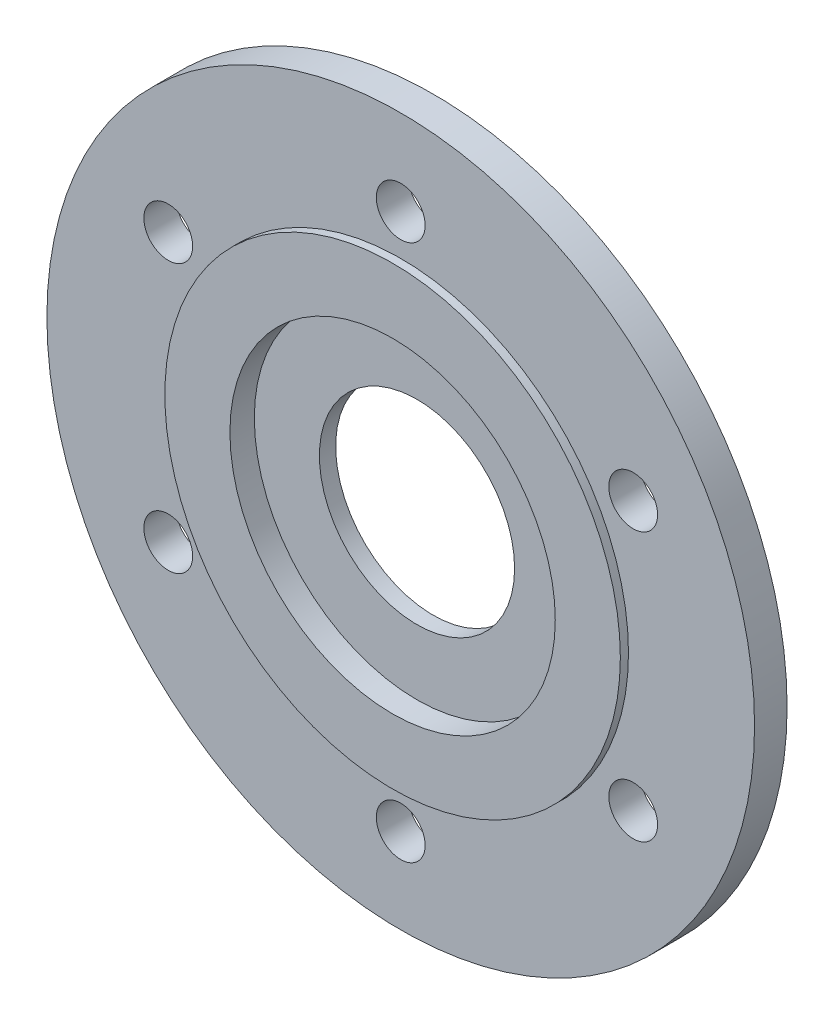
ISO-10303-21;
HEADER;
FILE_DESCRIPTION(('STEP AP214'),'2;1');
FILE_NAME('part.step','',(''),(''),'','','');
FILE_SCHEMA(('AUTOMOTIVE_DESIGN { 1 0 10303 214 1 1 1 1 }'));
ENDSEC;
DATA;
#1=APPLICATION_CONTEXT('core data for automotive mechanical design processes');
#2=APPLICATION_PROTOCOL_DEFINITION('international standard','automotive_design',2000,#1);
#3=PRODUCT_CONTEXT('',#1,'mechanical');
#4=PRODUCT('Part','Part','',(#3));
#5=PRODUCT_RELATED_PRODUCT_CATEGORY('part','',(#4));
#6=PRODUCT_DEFINITION_FORMATION('','',#4);
#7=PRODUCT_DEFINITION_CONTEXT('part definition',#1,'design');
#8=PRODUCT_DEFINITION('design','',#6,#7);
#9=PRODUCT_DEFINITION_SHAPE('','',#8);
#10=(LENGTH_UNIT() NAMED_UNIT(*) SI_UNIT(.MILLI.,.METRE.));
#11=(NAMED_UNIT(*) PLANE_ANGLE_UNIT() SI_UNIT($,.RADIAN.));
#12=(NAMED_UNIT(*) SI_UNIT($,.STERADIAN.) SOLID_ANGLE_UNIT());
#13=UNCERTAINTY_MEASURE_WITH_UNIT(LENGTH_MEASURE(1.E-05),#10,'distance_accuracy_value','');
#14=(GEOMETRIC_REPRESENTATION_CONTEXT(3) GLOBAL_UNCERTAINTY_ASSIGNED_CONTEXT((#13)) GLOBAL_UNIT_ASSIGNED_CONTEXT((#10,
#11,#12)) REPRESENTATION_CONTEXT('',''));
#15=CARTESIAN_POINT('',(0.,0.,0.));
#16=DIRECTION('',(0.,0.,1.));
#17=DIRECTION('',(1.,0.,0.));
#18=AXIS2_PLACEMENT_3D('',#15,#16,#17);
#19=CARTESIAN_POINT('',(0.,0.,4.));
#20=DIRECTION('',(0.,0.,1.));
#21=DIRECTION('',(1.,0.,0.));
#22=AXIS2_PLACEMENT_3D('',#19,#20,#21);
#23=PLANE('',#22);
#24=CARTESIAN_POINT('',(-28.5788383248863,16.5000000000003,4.));
#25=DIRECTION('',(0.,0.,1.));
#26=DIRECTION('',(0.50000000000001,0.866025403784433,0.));
#27=AXIS2_PLACEMENT_3D('',#24,#25,#26);
#28=CIRCLE('',#27,3.);
#29=CARTESIAN_POINT('',(-27.0788383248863,19.0980762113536,4.));
#30=VERTEX_POINT('',#29);
#31=EDGE_CURVE('E94',#30,#30,#28,.T.);
#32=ORIENTED_EDGE('',*,*,#31,.F.);
#33=EDGE_LOOP('',(#32));
#34=FACE_BOUND('',#33,.T.);
#35=CARTESIAN_POINT('',(-28.5788383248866,-16.4999999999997,4.));
#36=DIRECTION('',(0.,0.,1.));
#37=DIRECTION('',(-0.499999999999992,0.866025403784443,0.));
#38=AXIS2_PLACEMENT_3D('',#35,#36,#37);
#39=CIRCLE('',#38,3.);
#40=CARTESIAN_POINT('',(-30.0788383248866,-13.9019237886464,4.));
#41=VERTEX_POINT('',#40);
#42=EDGE_CURVE('E88',#41,#41,#39,.T.);
#43=ORIENTED_EDGE('',*,*,#42,.F.);
#44=EDGE_LOOP('',(#43));
#45=FACE_BOUND('',#44,.T.);
#46=CARTESIAN_POINT('',(-2.32187805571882E-13,-33.,4.));
#47=DIRECTION('',(0.,0.,1.));
#48=DIRECTION('',(-1.,0.,0.));
#49=AXIS2_PLACEMENT_3D('',#46,#47,#48);
#50=CIRCLE('',#49,3.);
#51=CARTESIAN_POINT('',(-3.00000000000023,-33.,4.));
#52=VERTEX_POINT('',#51);
#53=EDGE_CURVE('E82',#52,#52,#50,.T.);
#54=ORIENTED_EDGE('',*,*,#53,.F.);
#55=EDGE_LOOP('',(#54));
#56=FACE_BOUND('',#55,.T.);
#57=CARTESIAN_POINT('',(28.5788383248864,-16.5000000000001,4.));
#58=DIRECTION('',(0.,0.,1.));
#59=DIRECTION('',(-0.500000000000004,-0.866025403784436,0.));
#60=AXIS2_PLACEMENT_3D('',#57,#58,#59);
#61=CIRCLE('',#60,3.);
#62=CARTESIAN_POINT('',(27.0788383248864,-19.0980762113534,4.));
#63=VERTEX_POINT('',#62);
#64=EDGE_CURVE('E76',#63,#63,#61,.T.);
#65=ORIENTED_EDGE('',*,*,#64,.F.);
#66=EDGE_LOOP('',(#65));
#67=FACE_BOUND('',#66,.T.);
#68=CARTESIAN_POINT('',(28.5788383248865,16.4999999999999,4.));
#69=DIRECTION('',(0.,0.,1.));
#70=DIRECTION('',(0.499999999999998,-0.86602540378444,0.));
#71=AXIS2_PLACEMENT_3D('',#68,#69,#70);
#72=CIRCLE('',#71,3.);
#73=CARTESIAN_POINT('',(30.0788383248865,13.9019237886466,4.));
#74=VERTEX_POINT('',#73);
#75=EDGE_CURVE('E70',#74,#74,#72,.T.);
#76=ORIENTED_EDGE('',*,*,#75,.F.);
#77=EDGE_LOOP('',(#76));
#78=FACE_BOUND('',#77,.T.);
#79=CARTESIAN_POINT('',(0.,33.,4.));
#80=DIRECTION('',(0.,0.,1.));
#81=DIRECTION('',(1.,0.,0.));
#82=AXIS2_PLACEMENT_3D('',#79,#80,#81);
#83=CIRCLE('',#82,3.);
#84=CARTESIAN_POINT('',(3.,33.,4.));
#85=VERTEX_POINT('',#84);
#86=EDGE_CURVE('E64',#85,#85,#83,.T.);
#87=ORIENTED_EDGE('',*,*,#86,.F.);
#88=EDGE_LOOP('',(#87));
#89=FACE_BOUND('',#88,.T.);
#90=CARTESIAN_POINT('',(0.,0.,4.));
#91=DIRECTION('',(0.,0.,1.));
#92=DIRECTION('',(1.,0.,0.));
#93=AXIS2_PLACEMENT_3D('',#90,#91,#92);
#94=CIRCLE('',#93,43.5);
#95=CARTESIAN_POINT('',(43.5,0.,4.));
#96=VERTEX_POINT('',#95);
#97=EDGE_CURVE('E10',#96,#96,#94,.T.);
#98=ORIENTED_EDGE('',*,*,#97,.T.);
#99=EDGE_LOOP('',(#98));
#100=FACE_BOUND('',#99,.T.);
#101=CARTESIAN_POINT('',(0.,0.,4.));
#102=DIRECTION('',(0.,0.,1.));
#103=DIRECTION('',(1.,0.,0.));
#104=AXIS2_PLACEMENT_3D('',#101,#102,#103);
#105=CIRCLE('',#104,28.);
#106=CARTESIAN_POINT('',(28.,0.,4.));
#107=VERTEX_POINT('',#106);
#108=EDGE_CURVE('E44',#107,#107,#105,.T.);
#109=ORIENTED_EDGE('',*,*,#108,.F.);
#110=EDGE_LOOP('',(#109));
#111=FACE_BOUND('',#110,.T.);
#112=ADVANCED_FACE('F29',(#34,#45,#56,#67,#78,#89,#100,#111),#23,.T.);
#113=CARTESIAN_POINT('',(0.,0.,4.));
#114=DIRECTION('',(0.,0.,-1.));
#115=DIRECTION('',(-1.,0.,0.));
#116=AXIS2_PLACEMENT_3D('',#113,#114,#115);
#117=CYLINDRICAL_SURFACE('',#116,43.5);
#118=ORIENTED_EDGE('',*,*,#97,.F.);
#119=EDGE_LOOP('',(#118));
#120=FACE_BOUND('',#119,.T.);
#121=CARTESIAN_POINT('',(0.,0.,0.));
#122=DIRECTION('',(0.,0.,1.));
#123=DIRECTION('',(1.,0.,0.));
#124=AXIS2_PLACEMENT_3D('',#121,#122,#123);
#125=CIRCLE('',#124,43.5);
#126=CARTESIAN_POINT('',(43.5,0.,0.));
#127=VERTEX_POINT('',#126);
#128=EDGE_CURVE('E36',#127,#127,#125,.T.);
#129=ORIENTED_EDGE('',*,*,#128,.T.);
#130=EDGE_LOOP('',(#129));
#131=FACE_BOUND('',#130,.T.);
#132=ADVANCED_FACE('F31',(#120,#131),#117,.T.);
#133=CARTESIAN_POINT('',(0.,0.,0.));
#134=DIRECTION('',(0.,0.,1.));
#135=DIRECTION('',(1.,0.,0.));
#136=AXIS2_PLACEMENT_3D('',#133,#134,#135);
#137=PLANE('',#136);
#138=CARTESIAN_POINT('',(-28.5788383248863,16.5000000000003,0.));
#139=DIRECTION('',(0.,0.,1.));
#140=DIRECTION('',(0.50000000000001,0.866025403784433,0.));
#141=AXIS2_PLACEMENT_3D('',#138,#139,#140);
#142=CIRCLE('',#141,3.);
#143=CARTESIAN_POINT('',(-27.0788383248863,19.0980762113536,0.));
#144=VERTEX_POINT('',#143);
#145=EDGE_CURVE('E91',#144,#144,#142,.T.);
#146=ORIENTED_EDGE('',*,*,#145,.T.);
#147=EDGE_LOOP('',(#146));
#148=FACE_BOUND('',#147,.T.);
#149=CARTESIAN_POINT('',(-28.5788383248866,-16.4999999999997,0.));
#150=DIRECTION('',(0.,0.,1.));
#151=DIRECTION('',(-0.499999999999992,0.866025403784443,0.));
#152=AXIS2_PLACEMENT_3D('',#149,#150,#151);
#153=CIRCLE('',#152,3.);
#154=CARTESIAN_POINT('',(-30.0788383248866,-13.9019237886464,0.));
#155=VERTEX_POINT('',#154);
#156=EDGE_CURVE('E85',#155,#155,#153,.T.);
#157=ORIENTED_EDGE('',*,*,#156,.T.);
#158=EDGE_LOOP('',(#157));
#159=FACE_BOUND('',#158,.T.);
#160=CARTESIAN_POINT('',(-2.32187805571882E-13,-33.,0.));
#161=DIRECTION('',(0.,0.,1.));
#162=DIRECTION('',(-1.,0.,0.));
#163=AXIS2_PLACEMENT_3D('',#160,#161,#162);
#164=CIRCLE('',#163,3.);
#165=CARTESIAN_POINT('',(-3.00000000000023,-33.,0.));
#166=VERTEX_POINT('',#165);
#167=EDGE_CURVE('E79',#166,#166,#164,.T.);
#168=ORIENTED_EDGE('',*,*,#167,.T.);
#169=EDGE_LOOP('',(#168));
#170=FACE_BOUND('',#169,.T.);
#171=CARTESIAN_POINT('',(28.5788383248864,-16.5000000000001,0.));
#172=DIRECTION('',(0.,0.,1.));
#173=DIRECTION('',(-0.500000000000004,-0.866025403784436,0.));
#174=AXIS2_PLACEMENT_3D('',#171,#172,#173);
#175=CIRCLE('',#174,3.);
#176=CARTESIAN_POINT('',(27.0788383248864,-19.0980762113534,0.));
#177=VERTEX_POINT('',#176);
#178=EDGE_CURVE('E73',#177,#177,#175,.T.);
#179=ORIENTED_EDGE('',*,*,#178,.T.);
#180=EDGE_LOOP('',(#179));
#181=FACE_BOUND('',#180,.T.);
#182=CARTESIAN_POINT('',(28.5788383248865,16.4999999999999,0.));
#183=DIRECTION('',(0.,0.,1.));
#184=DIRECTION('',(0.499999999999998,-0.86602540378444,0.));
#185=AXIS2_PLACEMENT_3D('',#182,#183,#184);
#186=CIRCLE('',#185,3.);
#187=CARTESIAN_POINT('',(30.0788383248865,13.9019237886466,0.));
#188=VERTEX_POINT('',#187);
#189=EDGE_CURVE('E67',#188,#188,#186,.T.);
#190=ORIENTED_EDGE('',*,*,#189,.T.);
#191=EDGE_LOOP('',(#190));
#192=FACE_BOUND('',#191,.T.);
#193=CARTESIAN_POINT('',(0.,33.,0.));
#194=DIRECTION('',(0.,0.,1.));
#195=DIRECTION('',(1.,0.,0.));
#196=AXIS2_PLACEMENT_3D('',#193,#194,#195);
#197=CIRCLE('',#196,3.);
#198=CARTESIAN_POINT('',(3.,33.,0.));
#199=VERTEX_POINT('',#198);
#200=EDGE_CURVE('E61',#199,#199,#197,.T.);
#201=ORIENTED_EDGE('',*,*,#200,.T.);
#202=EDGE_LOOP('',(#201));
#203=FACE_BOUND('',#202,.T.);
#204=CARTESIAN_POINT('',(0.,0.,0.));
#205=DIRECTION('',(0.,0.,1.));
#206=DIRECTION('',(1.,0.,0.));
#207=AXIS2_PLACEMENT_3D('',#204,#205,#206);
#208=CIRCLE('',#207,12.);
#209=CARTESIAN_POINT('',(12.,0.,0.));
#210=VERTEX_POINT('',#209);
#211=EDGE_CURVE('E55',#210,#210,#208,.T.);
#212=ORIENTED_EDGE('',*,*,#211,.T.);
#213=EDGE_LOOP('',(#212));
#214=FACE_BOUND('',#213,.T.);
#215=ORIENTED_EDGE('',*,*,#128,.F.);
#216=EDGE_LOOP('',(#215));
#217=FACE_BOUND('',#216,.T.);
#218=ADVANCED_FACE('F117',(#148,#159,#170,#181,#192,#203,#214,#217),#137,.F.);
#219=CARTESIAN_POINT('',(0.,0.,5.));
#220=DIRECTION('',(0.,0.,-1.));
#221=DIRECTION('',(-1.,0.,0.));
#222=AXIS2_PLACEMENT_3D('',#219,#220,#221);
#223=CYLINDRICAL_SURFACE('',#222,28.);
#224=CARTESIAN_POINT('',(0.,0.,5.));
#225=DIRECTION('',(0.,0.,1.));
#226=DIRECTION('',(1.,0.,0.));
#227=AXIS2_PLACEMENT_3D('',#224,#225,#226);
#228=CIRCLE('',#227,28.);
#229=CARTESIAN_POINT('',(28.,0.,5.));
#230=VERTEX_POINT('',#229);
#231=EDGE_CURVE('E40',#230,#230,#228,.T.);
#232=ORIENTED_EDGE('',*,*,#231,.F.);
#233=EDGE_LOOP('',(#232));
#234=FACE_BOUND('',#233,.T.);
#235=ORIENTED_EDGE('',*,*,#108,.T.);
#236=EDGE_LOOP('',(#235));
#237=FACE_BOUND('',#236,.T.);
#238=ADVANCED_FACE('F114',(#234,#237),#223,.T.);
#239=CARTESIAN_POINT('',(0.,0.,5.));
#240=DIRECTION('',(0.,0.,1.));
#241=DIRECTION('',(1.,0.,0.));
#242=AXIS2_PLACEMENT_3D('',#239,#240,#241);
#243=PLANE('',#242);
#244=CARTESIAN_POINT('',(0.,0.,5.));
#245=DIRECTION('',(0.,0.,1.));
#246=DIRECTION('',(1.,0.,0.));
#247=AXIS2_PLACEMENT_3D('',#244,#245,#246);
#248=CIRCLE('',#247,20.);
#249=CARTESIAN_POINT('',(20.,0.,5.));
#250=VERTEX_POINT('',#249);
#251=EDGE_CURVE('E52',#250,#250,#248,.T.);
#252=ORIENTED_EDGE('',*,*,#251,.F.);
#253=EDGE_LOOP('',(#252));
#254=FACE_BOUND('',#253,.T.);
#255=ORIENTED_EDGE('',*,*,#231,.T.);
#256=EDGE_LOOP('',(#255));
#257=FACE_BOUND('',#256,.T.);
#258=ADVANCED_FACE('F116',(#254,#257),#243,.T.);
#259=CARTESIAN_POINT('',(0.,0.,2.));
#260=DIRECTION('',(0.,0.,1.));
#261=DIRECTION('',(1.,0.,0.));
#262=AXIS2_PLACEMENT_3D('',#259,#260,#261);
#263=CYLINDRICAL_SURFACE('',#262,20.);
#264=CARTESIAN_POINT('',(0.,0.,2.));
#265=DIRECTION('',(0.,0.,1.));
#266=DIRECTION('',(1.,0.,0.));
#267=AXIS2_PLACEMENT_3D('',#264,#265,#266);
#268=CIRCLE('',#267,20.);
#269=CARTESIAN_POINT('',(20.,0.,2.));
#270=VERTEX_POINT('',#269);
#271=EDGE_CURVE('E49',#270,#270,#268,.T.);
#272=ORIENTED_EDGE('',*,*,#271,.F.);
#273=EDGE_LOOP('',(#272));
#274=FACE_BOUND('',#273,.T.);
#275=ORIENTED_EDGE('',*,*,#251,.T.);
#276=EDGE_LOOP('',(#275));
#277=FACE_BOUND('',#276,.T.);
#278=ADVANCED_FACE('F124',(#274,#277),#263,.F.);
#279=CARTESIAN_POINT('',(0.,0.,2.));
#280=DIRECTION('',(0.,0.,1.));
#281=DIRECTION('',(1.,0.,0.));
#282=AXIS2_PLACEMENT_3D('',#279,#280,#281);
#283=PLANE('',#282);
#284=CARTESIAN_POINT('',(0.,0.,2.));
#285=DIRECTION('',(0.,0.,1.));
#286=DIRECTION('',(1.,0.,0.));
#287=AXIS2_PLACEMENT_3D('',#284,#285,#286);
#288=CIRCLE('',#287,12.);
#289=CARTESIAN_POINT('',(12.,0.,2.));
#290=VERTEX_POINT('',#289);
#291=EDGE_CURVE('E58',#290,#290,#288,.T.);
#292=ORIENTED_EDGE('',*,*,#291,.F.);
#293=EDGE_LOOP('',(#292));
#294=FACE_BOUND('',#293,.T.);
#295=ORIENTED_EDGE('',*,*,#271,.T.);
#296=EDGE_LOOP('',(#295));
#297=FACE_BOUND('',#296,.T.);
#298=ADVANCED_FACE('F134',(#294,#297),#283,.T.);
#299=CARTESIAN_POINT('',(0.,0.,0.));
#300=DIRECTION('',(0.,0.,1.));
#301=DIRECTION('',(1.,0.,0.));
#302=AXIS2_PLACEMENT_3D('',#299,#300,#301);
#303=CYLINDRICAL_SURFACE('',#302,12.);
#304=ORIENTED_EDGE('',*,*,#211,.F.);
#305=EDGE_LOOP('',(#304));
#306=FACE_BOUND('',#305,.T.);
#307=ORIENTED_EDGE('',*,*,#291,.T.);
#308=EDGE_LOOP('',(#307));
#309=FACE_BOUND('',#308,.T.);
#310=ADVANCED_FACE('F138',(#306,#309),#303,.F.);
#311=CARTESIAN_POINT('',(0.,33.,0.));
#312=DIRECTION('',(0.,0.,1.));
#313=DIRECTION('',(1.,0.,0.));
#314=AXIS2_PLACEMENT_3D('',#311,#312,#313);
#315=CYLINDRICAL_SURFACE('',#314,3.);
#316=ORIENTED_EDGE('',*,*,#200,.F.);
#317=EDGE_LOOP('',(#316));
#318=FACE_BOUND('',#317,.T.);
#319=ORIENTED_EDGE('',*,*,#86,.T.);
#320=EDGE_LOOP('',(#319));
#321=FACE_BOUND('',#320,.T.);
#322=ADVANCED_FACE('F142',(#318,#321),#315,.F.);
#323=CARTESIAN_POINT('',(28.5788383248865,16.4999999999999,0.));
#324=DIRECTION('',(0.,0.,1.));
#325=DIRECTION('',(1.,0.,0.));
#326=AXIS2_PLACEMENT_3D('',#323,#324,#325);
#327=CYLINDRICAL_SURFACE('',#326,3.);
#328=ORIENTED_EDGE('',*,*,#189,.F.);
#329=EDGE_LOOP('',(#328));
#330=FACE_BOUND('',#329,.T.);
#331=ORIENTED_EDGE('',*,*,#75,.T.);
#332=EDGE_LOOP('',(#331));
#333=FACE_BOUND('',#332,.T.);
#334=ADVANCED_FACE('F146',(#330,#333),#327,.F.);
#335=CARTESIAN_POINT('',(28.5788383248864,-16.5000000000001,0.));
#336=DIRECTION('',(0.,0.,1.));
#337=DIRECTION('',(1.,0.,0.));
#338=AXIS2_PLACEMENT_3D('',#335,#336,#337);
#339=CYLINDRICAL_SURFACE('',#338,3.);
#340=ORIENTED_EDGE('',*,*,#178,.F.);
#341=EDGE_LOOP('',(#340));
#342=FACE_BOUND('',#341,.T.);
#343=ORIENTED_EDGE('',*,*,#64,.T.);
#344=EDGE_LOOP('',(#343));
#345=FACE_BOUND('',#344,.T.);
#346=ADVANCED_FACE('F150',(#342,#345),#339,.F.);
#347=CARTESIAN_POINT('',(-2.32187805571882E-13,-33.,0.));
#348=DIRECTION('',(0.,0.,1.));
#349=DIRECTION('',(1.,0.,0.));
#350=AXIS2_PLACEMENT_3D('',#347,#348,#349);
#351=CYLINDRICAL_SURFACE('',#350,3.);
#352=ORIENTED_EDGE('',*,*,#167,.F.);
#353=EDGE_LOOP('',(#352));
#354=FACE_BOUND('',#353,.T.);
#355=ORIENTED_EDGE('',*,*,#53,.T.);
#356=EDGE_LOOP('',(#355));
#357=FACE_BOUND('',#356,.T.);
#358=ADVANCED_FACE('F154',(#354,#357),#351,.F.);
#359=CARTESIAN_POINT('',(-28.5788383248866,-16.4999999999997,0.));
#360=DIRECTION('',(0.,0.,1.));
#361=DIRECTION('',(1.,0.,0.));
#362=AXIS2_PLACEMENT_3D('',#359,#360,#361);
#363=CYLINDRICAL_SURFACE('',#362,3.);
#364=ORIENTED_EDGE('',*,*,#156,.F.);
#365=EDGE_LOOP('',(#364));
#366=FACE_BOUND('',#365,.T.);
#367=ORIENTED_EDGE('',*,*,#42,.T.);
#368=EDGE_LOOP('',(#367));
#369=FACE_BOUND('',#368,.T.);
#370=ADVANCED_FACE('F158',(#366,#369),#363,.F.);
#371=CARTESIAN_POINT('',(-28.5788383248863,16.5000000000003,0.));
#372=DIRECTION('',(0.,0.,1.));
#373=DIRECTION('',(1.,0.,0.));
#374=AXIS2_PLACEMENT_3D('',#371,#372,#373);
#375=CYLINDRICAL_SURFACE('',#374,3.);
#376=ORIENTED_EDGE('',*,*,#145,.F.);
#377=EDGE_LOOP('',(#376));
#378=FACE_BOUND('',#377,.T.);
#379=ORIENTED_EDGE('',*,*,#31,.T.);
#380=EDGE_LOOP('',(#379));
#381=FACE_BOUND('',#380,.T.);
#382=ADVANCED_FACE('F98',(#378,#381),#375,.F.);
#383=CLOSED_SHELL('',(#112,#132,#218,#238,#258,#278,#298,#310,#322,#334,#346,#358,#370,#382));
#384=MANIFOLD_SOLID_BREP('B2',#383);
#385=ADVANCED_BREP_SHAPE_REPRESENTATION('',(#18,#384),#14);
#386=SHAPE_DEFINITION_REPRESENTATION(#9,#385);
ENDSEC;
END-ISO-10303-21;
